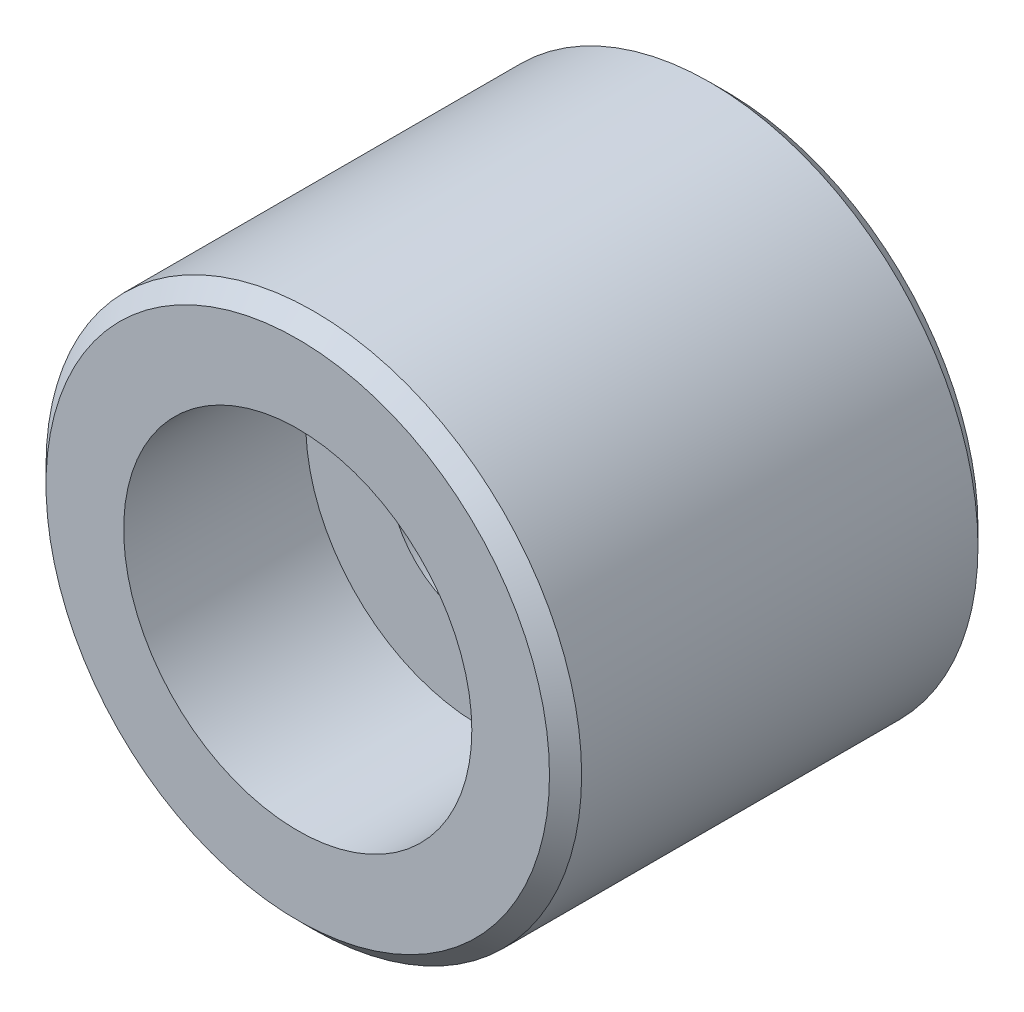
ISO-10303-21;
HEADER;
FILE_DESCRIPTION(('STEP AP214'),'2;1');
FILE_NAME('part.step','',(''),(''),'','','');
FILE_SCHEMA(('AUTOMOTIVE_DESIGN { 1 0 10303 214 1 1 1 1 }'));
ENDSEC;
DATA;
#1=APPLICATION_CONTEXT('core data for automotive mechanical design processes');
#2=APPLICATION_PROTOCOL_DEFINITION('international standard','automotive_design',2000,#1);
#3=PRODUCT_CONTEXT('',#1,'mechanical');
#4=PRODUCT('Part','Part','',(#3));
#5=PRODUCT_RELATED_PRODUCT_CATEGORY('part','',(#4));
#6=PRODUCT_DEFINITION_FORMATION('','',#4);
#7=PRODUCT_DEFINITION_CONTEXT('part definition',#1,'design');
#8=PRODUCT_DEFINITION('design','',#6,#7);
#9=PRODUCT_DEFINITION_SHAPE('','',#8);
#10=(LENGTH_UNIT() NAMED_UNIT(*) SI_UNIT(.MILLI.,.METRE.));
#11=(NAMED_UNIT(*) PLANE_ANGLE_UNIT() SI_UNIT($,.RADIAN.));
#12=(NAMED_UNIT(*) SI_UNIT($,.STERADIAN.) SOLID_ANGLE_UNIT());
#13=UNCERTAINTY_MEASURE_WITH_UNIT(LENGTH_MEASURE(1.E-05),#10,'distance_accuracy_value','');
#14=(GEOMETRIC_REPRESENTATION_CONTEXT(3) GLOBAL_UNCERTAINTY_ASSIGNED_CONTEXT((#13)) GLOBAL_UNIT_ASSIGNED_CONTEXT((#10,
#11,#12)) REPRESENTATION_CONTEXT('',''));
#15=CARTESIAN_POINT('',(0.,0.,0.));
#16=DIRECTION('',(0.,0.,1.));
#17=DIRECTION('',(1.,0.,0.));
#18=AXIS2_PLACEMENT_3D('',#15,#16,#17);
#19=CARTESIAN_POINT('',(0.,0.,8.));
#20=DIRECTION('',(0.,0.,-1.));
#21=DIRECTION('',(-1.,0.,0.));
#22=AXIS2_PLACEMENT_3D('',#19,#20,#21);
#23=CYLINDRICAL_SURFACE('',#22,5.);
#24=CARTESIAN_POINT('',(0.,0.,0.300000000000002));
#25=DIRECTION('',(0.,0.,1.));
#26=DIRECTION('',(1.,0.,0.));
#27=AXIS2_PLACEMENT_3D('',#24,#25,#26);
#28=CIRCLE('',#27,5.);
#29=CARTESIAN_POINT('',(5.,0.,0.300000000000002));
#30=VERTEX_POINT('',#29);
#31=EDGE_CURVE('E73',#30,#30,#28,.T.);
#32=ORIENTED_EDGE('',*,*,#31,.T.);
#33=EDGE_LOOP('',(#32));
#34=FACE_BOUND('',#33,.T.);
#35=CARTESIAN_POINT('',(0.,0.,7.7));
#36=DIRECTION('',(0.,0.,1.));
#37=DIRECTION('',(1.,0.,0.));
#38=AXIS2_PLACEMENT_3D('',#35,#36,#37);
#39=CIRCLE('',#38,5.);
#40=CARTESIAN_POINT('',(5.,0.,7.7));
#41=VERTEX_POINT('',#40);
#42=EDGE_CURVE('E77',#41,#41,#39,.F.);
#43=ORIENTED_EDGE('',*,*,#42,.T.);
#44=EDGE_LOOP('',(#43));
#45=FACE_BOUND('',#44,.T.);
#46=ADVANCED_FACE('F44',(#34,#45),#23,.T.);
#47=CARTESIAN_POINT('',(0.,0.,8.));
#48=DIRECTION('',(0.,0.,1.));
#49=DIRECTION('',(1.,0.,0.));
#50=AXIS2_PLACEMENT_3D('',#47,#48,#49);
#51=PLANE('',#50);
#52=CARTESIAN_POINT('',(0.,0.,8.));
#53=DIRECTION('',(0.,0.,1.));
#54=DIRECTION('',(1.,0.,0.));
#55=AXIS2_PLACEMENT_3D('',#52,#53,#54);
#56=CIRCLE('',#55,4.7);
#57=CARTESIAN_POINT('',(4.7,0.,8.));
#58=VERTEX_POINT('',#57);
#59=EDGE_CURVE('E10',#58,#58,#56,.T.);
#60=ORIENTED_EDGE('',*,*,#59,.T.);
#61=EDGE_LOOP('',(#60));
#62=FACE_BOUND('',#61,.T.);
#63=CARTESIAN_POINT('',(0.,0.,8.));
#64=DIRECTION('',(0.,0.,1.));
#65=DIRECTION('',(1.,0.,0.));
#66=AXIS2_PLACEMENT_3D('',#63,#64,#65);
#67=CIRCLE('',#66,3.25);
#68=CARTESIAN_POINT('',(3.25,0.,8.));
#69=VERTEX_POINT('',#68);
#70=EDGE_CURVE('E89',#69,#69,#67,.T.);
#71=ORIENTED_EDGE('',*,*,#70,.F.);
#72=EDGE_LOOP('',(#71));
#73=FACE_BOUND('',#72,.T.);
#74=ADVANCED_FACE('F98',(#62,#73),#51,.T.);
#75=CARTESIAN_POINT('',(0.,0.,0.));
#76=DIRECTION('',(0.,0.,1.));
#77=DIRECTION('',(1.,0.,0.));
#78=AXIS2_PLACEMENT_3D('',#75,#76,#77);
#79=PLANE('',#78);
#80=CARTESIAN_POINT('',(0.,0.,0.));
#81=DIRECTION('',(0.,0.,1.));
#82=DIRECTION('',(1.,0.,0.));
#83=AXIS2_PLACEMENT_3D('',#80,#81,#82);
#84=CIRCLE('',#83,4.7);
#85=CARTESIAN_POINT('',(4.7,0.,0.));
#86=VERTEX_POINT('',#85);
#87=EDGE_CURVE('E60',#86,#86,#84,.F.);
#88=ORIENTED_EDGE('',*,*,#87,.T.);
#89=EDGE_LOOP('',(#88));
#90=FACE_BOUND('',#89,.T.);
#91=CARTESIAN_POINT('',(0.,0.,0.));
#92=DIRECTION('',(0.,0.,1.));
#93=DIRECTION('',(1.,0.,0.));
#94=AXIS2_PLACEMENT_3D('',#91,#92,#93);
#95=CIRCLE('',#94,2.);
#96=CARTESIAN_POINT('',(-2.,0.,0.));
#97=VERTEX_POINT('',#96);
#98=EDGE_CURVE('E67',#97,#97,#95,.T.);
#99=ORIENTED_EDGE('',*,*,#98,.T.);
#100=EDGE_LOOP('',(#99));
#101=FACE_BOUND('',#100,.T.);
#102=ADVANCED_FACE('F100',(#90,#101),#79,.F.);
#103=CARTESIAN_POINT('',(0.,0.,8.));
#104=DIRECTION('',(0.,0.,1.));
#105=DIRECTION('',(1.,0.,0.));
#106=AXIS2_PLACEMENT_3D('',#103,#104,#105);
#107=CYLINDRICAL_SURFACE('',#106,1.7);
#108=CARTESIAN_POINT('',(0.,0.,0.300000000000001));
#109=DIRECTION('',(0.,0.,1.));
#110=DIRECTION('',(1.,0.,0.));
#111=AXIS2_PLACEMENT_3D('',#108,#109,#110);
#112=CIRCLE('',#111,1.7);
#113=CARTESIAN_POINT('',(-1.7,0.,0.300000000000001));
#114=VERTEX_POINT('',#113);
#115=EDGE_CURVE('E53',#114,#114,#112,.F.);
#116=ORIENTED_EDGE('',*,*,#115,.T.);
#117=EDGE_LOOP('',(#116));
#118=FACE_BOUND('',#117,.T.);
#119=CARTESIAN_POINT('',(0.,0.,4.6));
#120=DIRECTION('',(0.,0.,1.));
#121=DIRECTION('',(1.,0.,0.));
#122=AXIS2_PLACEMENT_3D('',#119,#120,#121);
#123=CIRCLE('',#122,1.7);
#124=CARTESIAN_POINT('',(1.7,0.,4.6));
#125=VERTEX_POINT('',#124);
#126=EDGE_CURVE('E81',#125,#125,#123,.T.);
#127=ORIENTED_EDGE('',*,*,#126,.T.);
#128=EDGE_LOOP('',(#127));
#129=FACE_BOUND('',#128,.T.);
#130=ADVANCED_FACE('F106',(#118,#129),#107,.F.);
#131=CARTESIAN_POINT('',(1.7,0.,4.6));
#132=DIRECTION('',(0.,0.,-1.));
#133=DIRECTION('',(-1.,0.,0.));
#134=AXIS2_PLACEMENT_3D('',#131,#132,#133);
#135=PLANE('',#134);
#136=ORIENTED_EDGE('',*,*,#126,.F.);
#137=EDGE_LOOP('',(#136));
#138=FACE_BOUND('',#137,.T.);
#139=CARTESIAN_POINT('',(0.,0.,4.6));
#140=DIRECTION('',(0.,0.,1.));
#141=DIRECTION('',(1.,0.,0.));
#142=AXIS2_PLACEMENT_3D('',#139,#140,#141);
#143=CIRCLE('',#142,3.25);
#144=CARTESIAN_POINT('',(3.25,0.,4.6));
#145=VERTEX_POINT('',#144);
#146=EDGE_CURVE('E85',#145,#145,#143,.T.);
#147=ORIENTED_EDGE('',*,*,#146,.T.);
#148=EDGE_LOOP('',(#147));
#149=FACE_BOUND('',#148,.T.);
#150=ADVANCED_FACE('F159',(#138,#149),#135,.F.);
#151=CARTESIAN_POINT('',(0.,0.,8.));
#152=DIRECTION('',(0.,0.,1.));
#153=DIRECTION('',(1.,0.,0.));
#154=AXIS2_PLACEMENT_3D('',#151,#152,#153);
#155=CYLINDRICAL_SURFACE('',#154,3.25);
#156=ORIENTED_EDGE('',*,*,#146,.F.);
#157=EDGE_LOOP('',(#156));
#158=FACE_BOUND('',#157,.T.);
#159=ORIENTED_EDGE('',*,*,#70,.T.);
#160=EDGE_LOOP('',(#159));
#161=FACE_BOUND('',#160,.T.);
#162=ADVANCED_FACE('F96',(#158,#161),#155,.F.);
#163=CARTESIAN_POINT('',(0.,0.,0.300000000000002));
#164=DIRECTION('',(0.,0.,1.));
#165=DIRECTION('',(1.,0.,0.));
#166=AXIS2_PLACEMENT_3D('',#163,#164,#165);
#167=CONICAL_SURFACE('',#166,5.,0.78539816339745);
#168=ORIENTED_EDGE('',*,*,#87,.F.);
#169=EDGE_LOOP('',(#168));
#170=FACE_BOUND('',#169,.T.);
#171=ORIENTED_EDGE('',*,*,#31,.F.);
#172=EDGE_LOOP('',(#171));
#173=FACE_BOUND('',#172,.T.);
#174=ADVANCED_FACE('F115',(#170,#173),#167,.T.);
#175=CARTESIAN_POINT('',(0.,0.,0.));
#176=DIRECTION('',(0.,0.,-1.));
#177=DIRECTION('',(-1.,0.,0.));
#178=AXIS2_PLACEMENT_3D('',#175,#176,#177);
#179=CONICAL_SURFACE('',#178,2.,0.78539816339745);
#180=CARTESIAN_POINT('',(-1.7,0.,0.300000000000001));
#181=CARTESIAN_POINT('',(-1.703125,0.,0.296875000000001));
#182=CARTESIAN_POINT('',(-1.70625,0.,0.293750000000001));
#183=CARTESIAN_POINT('',(-1.7125,0.,0.287500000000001));
#184=CARTESIAN_POINT('',(-1.715625,0.,0.284375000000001));
#185=CARTESIAN_POINT('',(-1.721875,0.,0.278125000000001));
#186=CARTESIAN_POINT('',(-1.725,0.,0.275000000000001));
#187=CARTESIAN_POINT('',(-1.73125,0.,0.268750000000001));
#188=CARTESIAN_POINT('',(-1.734375,0.,0.265625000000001));
#189=CARTESIAN_POINT('',(-1.740625,0.,0.259375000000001));
#190=CARTESIAN_POINT('',(-1.74375,0.,0.256250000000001));
#191=CARTESIAN_POINT('',(-1.75,0.,0.250000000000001));
#192=CARTESIAN_POINT('',(-1.753125,0.,0.246875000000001));
#193=CARTESIAN_POINT('',(-1.759375,0.,0.240625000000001));
#194=CARTESIAN_POINT('',(-1.7625,0.,0.237500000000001));
#195=CARTESIAN_POINT('',(-1.76875,0.,0.231250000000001));
#196=CARTESIAN_POINT('',(-1.771875,0.,0.228125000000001));
#197=CARTESIAN_POINT('',(-1.778125,0.,0.221875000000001));
#198=CARTESIAN_POINT('',(-1.78125,0.,0.218750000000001));
#199=CARTESIAN_POINT('',(-1.7875,0.,0.212500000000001));
#200=CARTESIAN_POINT('',(-1.790625,0.,0.209375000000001));
#201=CARTESIAN_POINT('',(-1.796875,0.,0.203125));
#202=CARTESIAN_POINT('',(-1.8,0.,0.200000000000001));
#203=CARTESIAN_POINT('',(-1.80625,0.,0.19375));
#204=CARTESIAN_POINT('',(-1.809375,0.,0.190625));
#205=CARTESIAN_POINT('',(-1.815625,0.,0.184375));
#206=CARTESIAN_POINT('',(-1.81875,0.,0.18125));
#207=CARTESIAN_POINT('',(-1.825,0.,0.175));
#208=CARTESIAN_POINT('',(-1.828125,0.,0.171875));
#209=CARTESIAN_POINT('',(-1.834375,0.,0.165625));
#210=CARTESIAN_POINT('',(-1.8375,0.,0.1625));
#211=CARTESIAN_POINT('',(-1.84375,0.,0.15625));
#212=CARTESIAN_POINT('',(-1.846875,0.,0.153125));
#213=CARTESIAN_POINT('',(-1.853125,0.,0.146875));
#214=CARTESIAN_POINT('',(-1.85625,0.,0.14375));
#215=CARTESIAN_POINT('',(-1.8625,0.,0.1375));
#216=CARTESIAN_POINT('',(-1.865625,0.,0.134375));
#217=CARTESIAN_POINT('',(-1.871875,0.,0.128125));
#218=CARTESIAN_POINT('',(-1.875,0.,0.125));
#219=CARTESIAN_POINT('',(-1.88125,0.,0.11875));
#220=CARTESIAN_POINT('',(-1.884375,0.,0.115625));
#221=CARTESIAN_POINT('',(-1.890625,0.,0.109375));
#222=CARTESIAN_POINT('',(-1.89375,0.,0.10625));
#223=CARTESIAN_POINT('',(-1.9,0.,0.1));
#224=CARTESIAN_POINT('',(-1.903125,0.,0.0968750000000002));
#225=CARTESIAN_POINT('',(-1.909375,0.,0.0906250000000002));
#226=CARTESIAN_POINT('',(-1.9125,0.,0.0875000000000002));
#227=CARTESIAN_POINT('',(-1.91875,0.,0.0812500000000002));
#228=CARTESIAN_POINT('',(-1.921875,0.,0.0781250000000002));
#229=CARTESIAN_POINT('',(-1.928125,0.,0.0718750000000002));
#230=CARTESIAN_POINT('',(-1.93125,0.,0.0687500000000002));
#231=CARTESIAN_POINT('',(-1.9375,0.,0.0625000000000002));
#232=CARTESIAN_POINT('',(-1.940625,0.,0.0593750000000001));
#233=CARTESIAN_POINT('',(-1.946875,0.,0.0531250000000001));
#234=CARTESIAN_POINT('',(-1.95,0.,0.0500000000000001));
#235=CARTESIAN_POINT('',(-1.95625,0.,0.0437500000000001));
#236=CARTESIAN_POINT('',(-1.959375,0.,0.0406250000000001));
#237=CARTESIAN_POINT('',(-1.965625,0.,0.0343750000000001));
#238=CARTESIAN_POINT('',(-1.96875,0.,0.0312500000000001));
#239=CARTESIAN_POINT('',(-1.975,0.,0.0250000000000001));
#240=CARTESIAN_POINT('',(-1.978125,0.,0.0218750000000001));
#241=CARTESIAN_POINT('',(-1.984375,0.,0.015625));
#242=CARTESIAN_POINT('',(-1.9875,0.,0.0125));
#243=CARTESIAN_POINT('',(-1.99375,0.,0.00625));
#244=CARTESIAN_POINT('',(-1.996875,0.,0.00312499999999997));
#245=CARTESIAN_POINT('',(-2.,0.,0.));
#246=B_SPLINE_CURVE_WITH_KNOTS('',3,(#180,#181,#182,#183,#184,#185,#186,#187,#188,#189,#190,
#191,#192,#193,#194,#195,#196,#197,#198,#199,#200,#201,#202,#203,#204,#205,#206,#207,#208,#209,
#210,#211,#212,#213,#214,#215,#216,#217,#218,#219,#220,#221,#222,#223,#224,#225,#226,#227,#228,
#229,#230,#231,#232,#233,#234,#235,#236,#237,#238,#239,#240,#241,#242,#243,#244,#245),
.UNSPECIFIED.,.F.,.F.,(4,2,2,2,2,2,2,2,2,2,2,2,2,2,2,2,2,2,2,2,2,2,2,2,2,2,2,2,2,2,2,2,4),(0.,
0.0132582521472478,0.0265165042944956,0.0397747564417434,0.0530330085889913,0.0662912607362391,
0.0795495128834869,0.0928077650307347,0.106066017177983,0.11932426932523,0.132582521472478,
0.145840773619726,0.159099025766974,0.172357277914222,0.185615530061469,0.198873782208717,
0.212132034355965,0.225390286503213,0.238648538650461,0.251906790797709,0.265165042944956,
0.278423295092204,0.291681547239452,0.3049397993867,0.318198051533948,0.331456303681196,
0.344714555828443,0.357972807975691,0.371231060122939,0.384489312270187,0.397747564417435,
0.411005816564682,0.42426406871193),.UNSPECIFIED.);
#247=EDGE_CURVE('BSEAM120',#114,#97,#246,.T.);
#248=ORIENTED_EDGE('',*,*,#115,.F.);
#249=ORIENTED_EDGE('',*,*,#98,.F.);
#250=ORIENTED_EDGE('',*,*,#247,.T.);
#251=ORIENTED_EDGE('',*,*,#247,.F.);
#252=EDGE_LOOP('',(#248,#250,#249,#251));
#253=FACE_BOUND('',#252,.T.);
#254=ADVANCED_FACE('F120',(#253),#179,.F.);
#255=CARTESIAN_POINT('',(0.,0.,8.));
#256=DIRECTION('',(0.,0.,-1.));
#257=DIRECTION('',(-1.,0.,0.));
#258=AXIS2_PLACEMENT_3D('',#255,#256,#257);
#259=CONICAL_SURFACE('',#258,4.7,0.785398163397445);
#260=ORIENTED_EDGE('',*,*,#42,.F.);
#261=EDGE_LOOP('',(#260));
#262=FACE_BOUND('',#261,.T.);
#263=ORIENTED_EDGE('',*,*,#59,.F.);
#264=EDGE_LOOP('',(#263));
#265=FACE_BOUND('',#264,.T.);
#266=ADVANCED_FACE('F47',(#262,#265),#259,.T.);
#267=CLOSED_SHELL('',(#46,#74,#102,#130,#150,#162,#174,#254,#266));
#268=MANIFOLD_SOLID_BREP('B2',#267);
#269=ADVANCED_BREP_SHAPE_REPRESENTATION('',(#18,#268),#14);
#270=SHAPE_DEFINITION_REPRESENTATION(#9,#269);
ENDSEC;
END-ISO-10303-21;
